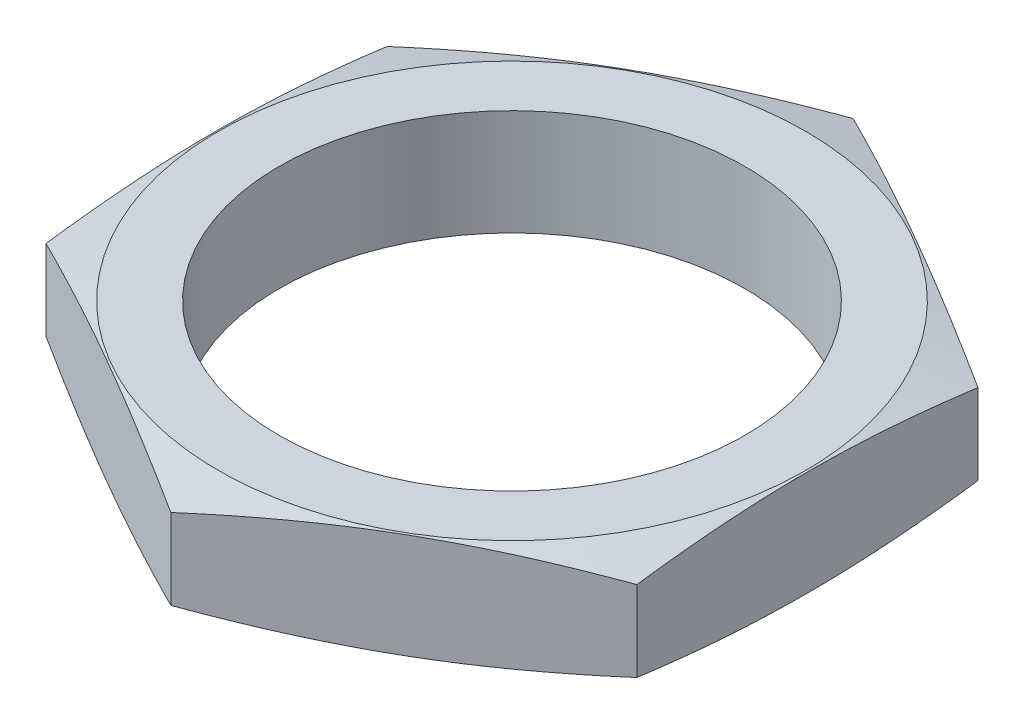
from build123d import *

# Parameters (mm, degrees)
BOSS_EXTRU_1_DEPTH     = 2.5
TROU_TARAUD_M12X1_01_D = 11


with BuildPart() as part:
    # Esquisse1 → Boss.-Extru.1 (new body)
    with BuildSketch(Plane(origin=(0, 0, 0), x_dir=(1, 0, 0), z_dir=(0, 1, 0))):
        Polygon((-6.975, -4.027018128), (0, -8.054036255), (6.975, -4.027018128), (6.975, 4.027018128), (0, 8.054036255), (-6.975, 4.027018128), align=None)
    extrude(amount=BOSS_EXTRU_1_DEPTH)

    # Trou taraud_ M12x1.01 (through all)
    with Locations(Plane(origin=(0, 2.5, 0), x_dir=(1, 0, 0), z_dir=(0, 1, 0))):
        with Locations((0, 0)):
            Hole(TROU_TARAUD_M12X1_01_D / 2)

    # Esquisse4 → Enl_vement de mati_re-R_volution1 (revolve, cut)
    with BuildSketch(Plane(origin=(0, 0, 0), x_dir=(0, 0, -1), z_dir=(1, 0, 0)), mode=Mode.PRIVATE) as enl_vement_de_mati_re_r_volution1_sk:
        Polygon((-8.054036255, 2.5), (-8.054036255, 2.2), (-6.934421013, 2.5), align=None)
        Polygon((-8.054036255, 0), (-6.934421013, 0), (-8.054036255, 0.3), align=None)
    revolve(enl_vement_de_mati_re_r_volution1_sk.sketch.rotate(Axis((0, 0, 0), (0, 1, 0)), 180), axis=Axis((0, 0, 0), (0, 1, 0)), mode=Mode.SUBTRACT)


solid = part.part
